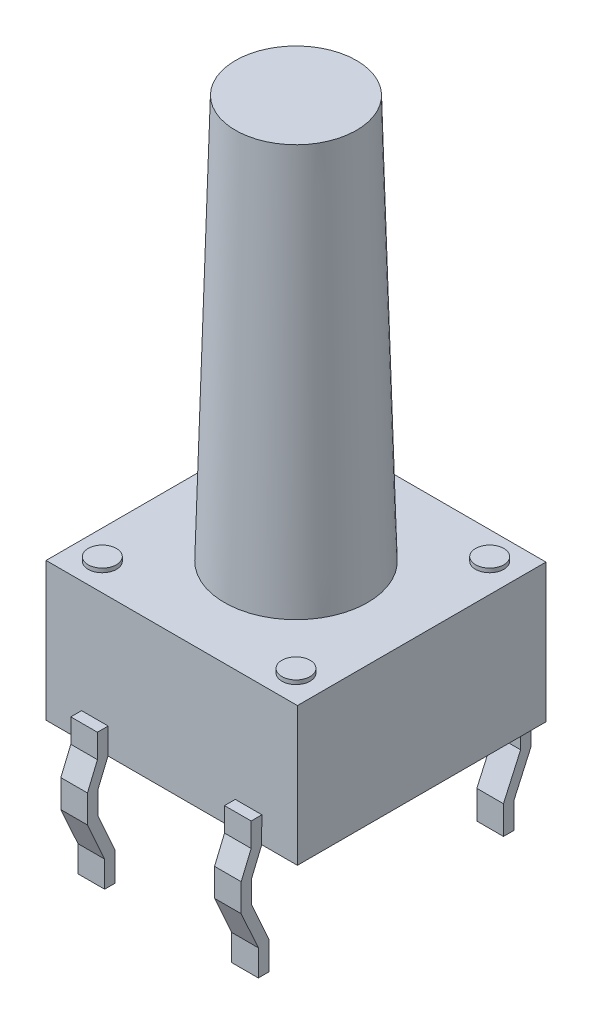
from build123d import *

# Parameters (mm, degrees)
ESQUISSE1_W               = 6.23
ESQUISSE1_H               = 6.16
EXTRUSION1_DEPTH          = 3.43
ESQUISSE3_W               = 0.66
ESQUISSE3_H               = 0.261460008
SYM_TRIE2_COPY_1_SKETCH_W = 0.66
SYM_TRIE2_COPY_1_SKETCH_H = 0.261460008
ESQUISSE5_R               = 0.35
EXTRUSION3_DEPTH          = 0.1


with BuildPart() as part:
    # Esquisse1 → Extrusion1 (new body)
    with BuildSketch(Plane(origin=(0, 0, 0), x_dir=(1, 0, 0), z_dir=(0, 1, 0))):
        Rectangle(ESQUISSE1_W, ESQUISSE1_H)
    extrude(amount=EXTRUSION1_DEPTH)

    # Balayage1: sweep along a path in Esquisse4
    with BuildLine(Plane(origin=(1.575, 0, 0), x_dir=(0, 0, -1), z_dir=(1, 0, 0))) as balayage1_path:
        Line((-2.877614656, 0.502870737), (-3.203673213, 0.502870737))
        Line((-3.203673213, 0.502870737), (-3.203673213, 0.027900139))
        Line((-3.203673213, 0.027900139), (-3.450375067, -0.563178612))
        Line((-3.450375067, -0.563178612), (-3.450375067, -1.191085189))
        Line((-3.450375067, -1.191085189), (-3.025266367, -2.135488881))
        Line((-3.025266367, -2.135488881), (-3.025266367, -2.813786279))
    # Esquisse3 → Balayage1 (sweep)
    with BuildSketch(Plane.XY.offset(3.08)):
        with Locations((1.905, 0.515156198)):
            Rectangle(ESQUISSE3_W, ESQUISSE3_H)
    balayage1 = sweep(path=balayage1_path.line, transition=Transition.RIGHT)

    # Sym_trie1: Balayage1 across plane
    add(balayage1.mirror(Plane(origin=(0, 0, 0), x_dir=(0, 0, 1), z_dir=(1, 0, 0))))

    # Sym_trie2: Balayage1 across plane
    add(balayage1.mirror(Plane.XY))

    # Sym_trie2 copy 1: sweep along a path in Sym_trie2 copy 1 path
    with BuildLine(Plane.ZY.offset(1.575)) as sym_trie2_copy_1_path:
        Line((-2.877614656, 0.502870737), (-3.203673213, 0.502870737))
        Line((-3.203673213, 0.502870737), (-3.203673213, 0.027900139))
        Line((-3.203673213, 0.027900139), (-3.450375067, -0.563178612))
        Line((-3.450375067, -0.563178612), (-3.450375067, -1.191085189))
        Line((-3.450375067, -1.191085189), (-3.025266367, -2.135488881))
        Line((-3.025266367, -2.135488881), (-3.025266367, -2.813786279))
    # Sym_trie2 copy 1 sketch → Sym_trie2 copy 1 (sweep)
    with BuildSketch(Plane(origin=(0, 0, -3.08), x_dir=(-1, 0, 0), z_dir=(0, 0, -1))):
        with Locations((1.905, 0.515156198)):
            Rectangle(SYM_TRIE2_COPY_1_SKETCH_W, SYM_TRIE2_COPY_1_SKETCH_H)
    sweep(path=sym_trie2_copy_1_path.line, transition=Transition.RIGHT)

    # Esquisse5 → Extrusion3 (add)
    with BuildSketch(Plane(origin=(0, 3.43, 0), x_dir=(-1, 0, 0), z_dir=(0, 1, 0))):
        with Locations(Location((-2.400025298, 2.400025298, 0), (0, 0, 270))):
            Circle(ESQUISSE5_R)
        with Locations(Location((-2.400025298, -2.400025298, 0), (0, 0, 270))):
            Circle(ESQUISSE5_R)
        with Locations(Location((2.400025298, -2.400025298, 0), (0, 0, 270))):
            Circle(ESQUISSE5_R)
        with Locations(Location((2.400025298, 2.400025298, 0), (0, 0, 270))):
            Circle(ESQUISSE5_R)
    extrude(amount=EXTRUSION3_DEPTH)

    # Esquisse6 → R_volution1 (revolve)
    with BuildSketch(Plane(origin=(0, 0, 0), x_dir=(0, 0, -1), z_dir=(1, 0, 0)), mode=Mode.PRIVATE) as r_volution1_sk:
        Polygon((0, 3.43), (-1.775, 3.43), (-1.5, 13.43), (0, 13.43), align=None)
    revolve(r_volution1_sk.sketch.rotate(Axis((0, -0.917603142, 0), (0, 1, 0)), 180), axis=Axis((0, -0.917603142, 0), (0, 1, 0)))


solid = part.part
